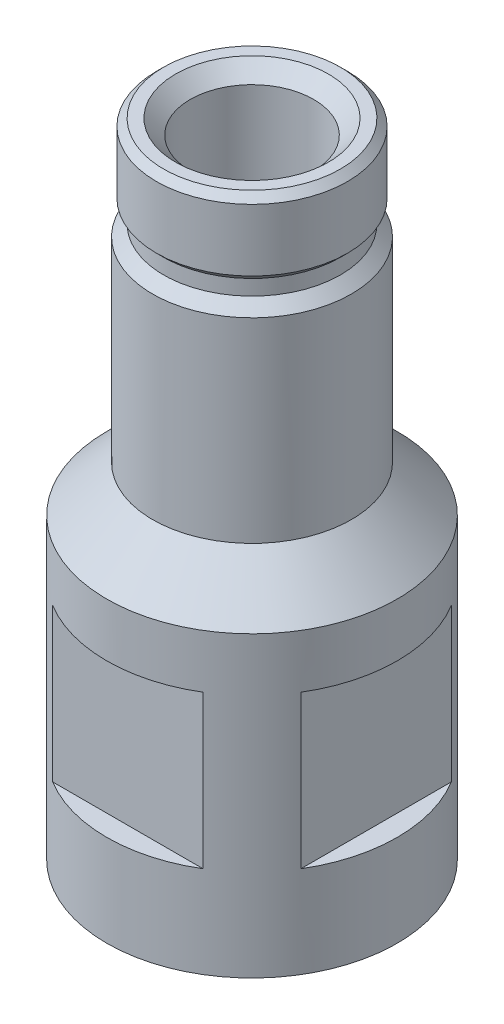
from build123d import *

# Parameters (mm, degrees)
SKETCH1_R            = 12.065
EXTRUDE1_DEPTH       = 53.34
CUT_EXTRUDE1_START   = -7.62
SKETCH10_OUTSIDE_W   = 38.794
SKETCH10_OUTSIDE_H   = 38.794
SKETCH10_OUTSIDE_W_2 = 20.6375
SKETCH10_OUTSIDE_H_2 = 20.6375
CUT_EXTRUDE1_DEPTH   = 12.7
SKETCH11_W           = 2.5654
SKETCH11_H           = 1.27


with BuildPart() as part:
    # Sketch1 → Extrude1 (new body)
    with BuildSketch(Plane(origin=(0, 0, 0), x_dir=(1, 0, 0), z_dir=(0, 1, 0))):
        with Locations(Location((0, 0, 0), (0, 0, 270))):
            Circle(SKETCH1_R)
    extrude(amount=EXTRUDE1_DEPTH)

    # Sketch6 → Cut-Revolve2 (revolve, cut)
    with BuildSketch(Plane.XY):
        Polygon((-5.7531, 25.4), (-5.1308, 25.4), (-5.1308, 52.1208), (-6.35, 53.34), (0, 53.34), (0, 0), (-6.1341, 0), (-6.1341, 3.175), (-5.7531, 3.394970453), align=None)
        Polygon((-12.065, 53.34), (-8.255, 53.34), (-8.255, 28.575), (-12.065, 24.765), align=None)
    revolve(axis=Axis((0, 0, 0), (0, -1, 0)), mode=Mode.SUBTRACT)

    # Sketch9 → Cut-Revolve4 (revolve, cut)
    with BuildSketch(Plane.XY, mode=Mode.PRIVATE) as cut_revolve4_sk:
        Polygon((-8.255, 44.8056), (-7.3406, 45.72), (-7.3406, 46.99), (-7.9375, 47.5869), (-7.9375, 52.7431), (-7.3406, 53.34), (-8.255, 53.34), align=None)
    revolve(cut_revolve4_sk.sketch.rotate(Axis((0, 53.34, 0), (0, 1, 0)), 180), axis=Axis((0, 53.34, 0), (0, 1, 0)), mode=Mode.SUBTRACT)

    # Sketch10 outside → Cut-Extrude1 (cut)
    with BuildSketch(Plane.XZ.offset(CUT_EXTRUDE1_START)):
        Rectangle(SKETCH10_OUTSIDE_W, SKETCH10_OUTSIDE_H)
        Rectangle(SKETCH10_OUTSIDE_W_2, SKETCH10_OUTSIDE_H_2, mode=Mode.SUBTRACT)
    extrude(amount=-CUT_EXTRUDE1_DEPTH, mode=Mode.SUBTRACT)

    # Sketch11 → Cut-Revolve5 (revolve, cut)
    with BuildSketch(Plane.XY):
        with Locations((-9.8679, 0.635)):
            Rectangle(SKETCH11_W, SKETCH11_H)
    revolve(axis=Axis((0, 0, 0), (0, -1, 0)), mode=Mode.SUBTRACT)


solid = part.part
